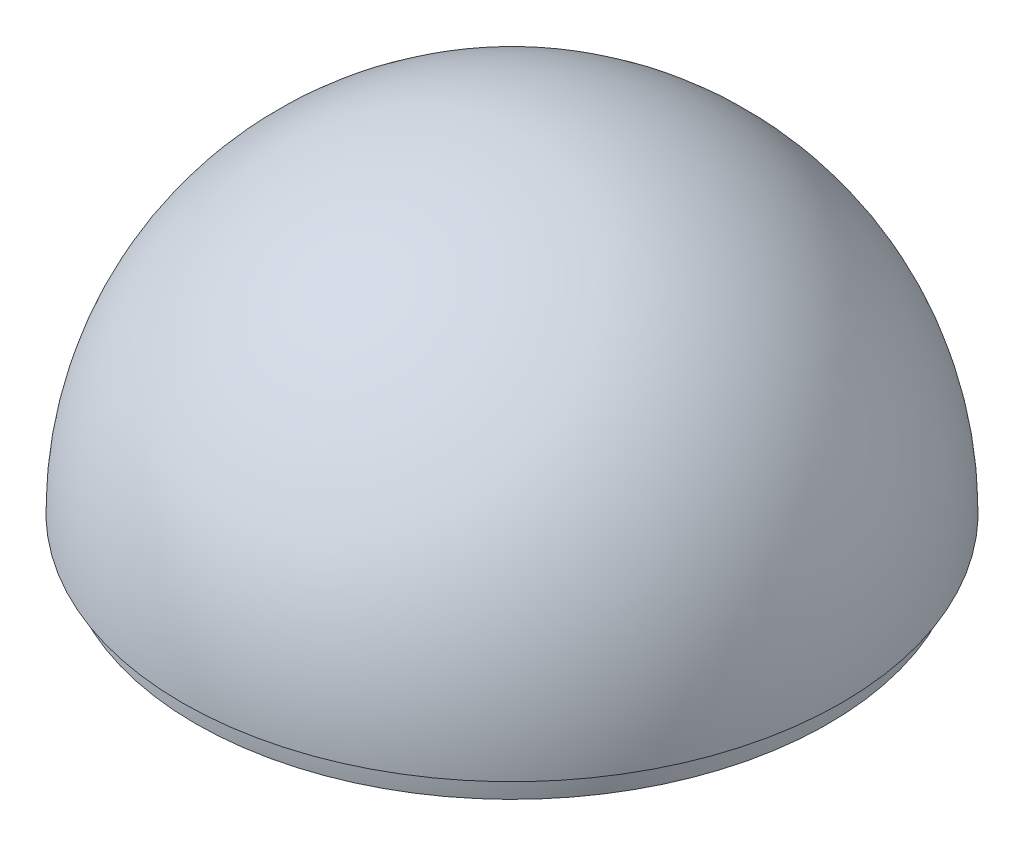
from build123d import *


with BuildPart() as part:
    # Esquisse1 → R_vol.-Mince1 (revolve)
    with BuildSketch(Plane.XY):
        with BuildLine():
            ThreePointArc((40, 102.003499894), (28.284271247, 130.287771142), (0, 142.003499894))
            Line((0, 142.003499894), (0, 139.003499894))
            ThreePointArc((0, 139.003499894), (26.162950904, 128.166450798), (37, 102.003499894))
            Line((37, 102.003499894), (40, 102.003499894))
        make_face()
    revolve(axis=Axis((0, 147.104912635, 0), (0, -1, 0)))

    # Esquisse2 → R_volution1 (revolve)
    with BuildSketch(Plane.XY):
        with BuildLine():
            Line((37, 102.003499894), (38.5, 102.003499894))
            ThreePointArc((38.5, 102.003499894), (38.470723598, 100.502358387), (38.382938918, 99.003499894))
            Line((38.382938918, 99.003499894), (37, 99.003499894))
            Line((37, 99.003499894), (37, 102.003499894))
        make_face()
    revolve(axis=Axis((0, 111.941040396, 0), (0, -1, 0)))


solid = part.part
